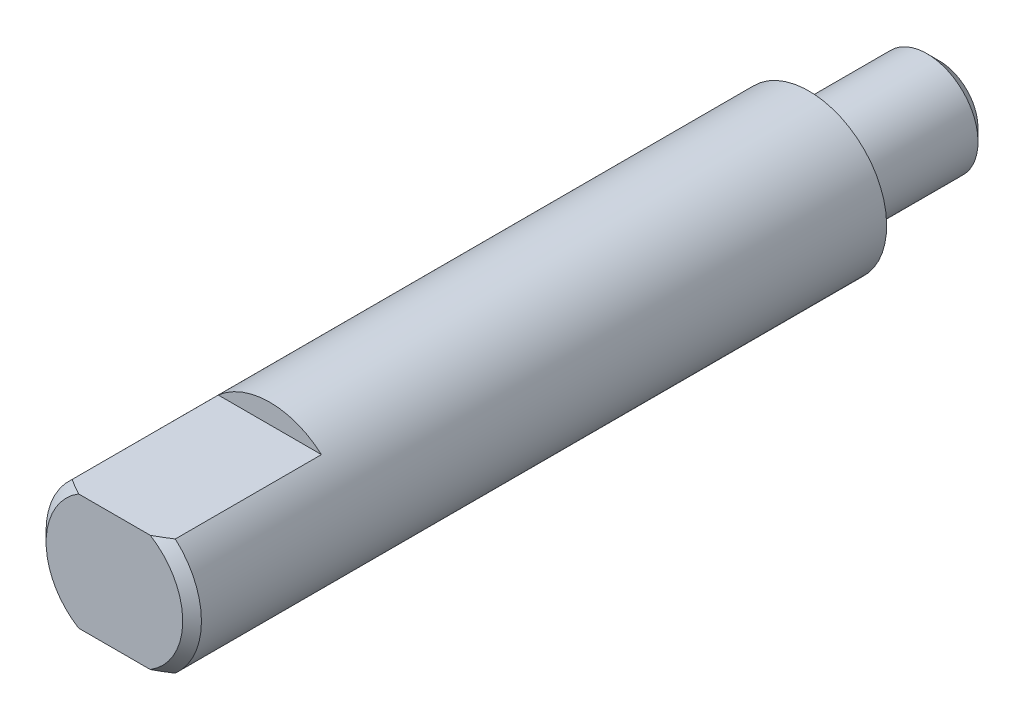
ISO-10303-21;
HEADER;
FILE_DESCRIPTION(('STEP AP214'),'2;1');
FILE_NAME('part.step','',(''),(''),'','','');
FILE_SCHEMA(('AUTOMOTIVE_DESIGN { 1 0 10303 214 1 1 1 1 }'));
ENDSEC;
DATA;
#1=APPLICATION_CONTEXT('core data for automotive mechanical design processes');
#2=APPLICATION_PROTOCOL_DEFINITION('international standard','automotive_design',2000,#1);
#3=PRODUCT_CONTEXT('',#1,'mechanical');
#4=PRODUCT('Part','Part','',(#3));
#5=PRODUCT_RELATED_PRODUCT_CATEGORY('part','',(#4));
#6=PRODUCT_DEFINITION_FORMATION('','',#4);
#7=PRODUCT_DEFINITION_CONTEXT('part definition',#1,'design');
#8=PRODUCT_DEFINITION('design','',#6,#7);
#9=PRODUCT_DEFINITION_SHAPE('','',#8);
#10=(LENGTH_UNIT() NAMED_UNIT(*) SI_UNIT(.MILLI.,.METRE.));
#11=(NAMED_UNIT(*) PLANE_ANGLE_UNIT() SI_UNIT($,.RADIAN.));
#12=(NAMED_UNIT(*) SI_UNIT($,.STERADIAN.) SOLID_ANGLE_UNIT());
#13=UNCERTAINTY_MEASURE_WITH_UNIT(LENGTH_MEASURE(1.E-05),#10,'distance_accuracy_value','');
#14=(GEOMETRIC_REPRESENTATION_CONTEXT(3) GLOBAL_UNCERTAINTY_ASSIGNED_CONTEXT((#13)) GLOBAL_UNIT_ASSIGNED_CONTEXT((#10,
#11,#12)) REPRESENTATION_CONTEXT('',''));
#15=CARTESIAN_POINT('',(0.,0.,0.));
#16=DIRECTION('',(0.,0.,1.));
#17=DIRECTION('',(1.,0.,0.));
#18=AXIS2_PLACEMENT_3D('',#15,#16,#17);
#19=CARTESIAN_POINT('',(0.,0.,3.684));
#20=DIRECTION('',(0.,0.,-1.));
#21=DIRECTION('',(0.,1.,0.));
#22=AXIS2_PLACEMENT_3D('',#19,#20,#21);
#23=CONICAL_SURFACE('',#22,3.175,0.791934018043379);
#24=CARTESIAN_POINT('',(0.,0.,3.684));
#25=DIRECTION('',(0.,0.,1.));
#26=DIRECTION('',(0.,-1.,0.));
#27=AXIS2_PLACEMENT_3D('',#24,#25,#26);
#28=CIRCLE('',#27,3.175);
#29=CARTESIAN_POINT('',(-2.10713075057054,2.375,3.684));
#30=VERTEX_POINT('',#29);
#31=CARTESIAN_POINT('',(-2.10713075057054,-2.375,3.684));
#32=VERTEX_POINT('',#31);
#33=EDGE_CURVE('E105',#30,#32,#28,.T.);
#34=ORIENTED_EDGE('',*,*,#33,.T.);
#35=CARTESIAN_POINT('',(-6.62966945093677,-2.375,-0.13301595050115));
#36=CARTESIAN_POINT('',(-6.41872085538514,-2.375,0.0629362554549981));
#37=CARTESIAN_POINT('',(-6.20729327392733,-2.375,0.258380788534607));
#38=CARTESIAN_POINT('',(-5.78286017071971,-2.375,0.647887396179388));
#39=CARTESIAN_POINT('',(-5.56985352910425,-2.375,0.841948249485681));
#40=CARTESIAN_POINT('',(-5.13574053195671,-2.375,1.23363349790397));
#41=CARTESIAN_POINT('',(-4.91457904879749,-2.375,1.43119690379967));
#42=CARTESIAN_POINT('',(-4.46963283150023,-2.375,1.82304516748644));
#43=CARTESIAN_POINT('',(-4.24585006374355,-2.375,2.01733224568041));
#44=CARTESIAN_POINT('',(-3.90719638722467,-2.375,2.30510248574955));
#45=CARTESIAN_POINT('',(-3.79385459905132,-2.375,2.40038380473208));
#46=CARTESIAN_POINT('',(-3.56590809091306,-2.375,2.58942155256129));
#47=CARTESIAN_POINT('',(-3.4513034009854,-2.375,2.68317801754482));
#48=CARTESIAN_POINT('',(-3.22025369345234,-2.375,2.86895465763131));
#49=CARTESIAN_POINT('',(-3.10380502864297,-2.375,2.96097030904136));
#50=CARTESIAN_POINT('',(-2.86892224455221,-2.375,3.14241965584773));
#51=CARTESIAN_POINT('',(-2.75048831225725,-2.375,3.23185359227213));
#52=CARTESIAN_POINT('',(-2.51255729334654,-2.375,3.40617108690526));
#53=CARTESIAN_POINT('',(-2.39309165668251,-2.375,3.49109735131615));
#54=CARTESIAN_POINT('',(-2.15090508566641,-2.375,3.65634247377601));
#55=CARTESIAN_POINT('',(-2.02818269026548,-2.375,3.73665921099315));
#56=CARTESIAN_POINT('',(-1.77912466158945,-2.375,3.89039659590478));
#57=CARTESIAN_POINT('',(-1.6528052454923,-2.375,3.96384327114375));
#58=CARTESIAN_POINT('',(-1.39512518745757,-2.375,4.10119391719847));
#59=CARTESIAN_POINT('',(-1.26377071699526,-2.375,4.16510912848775));
#60=CARTESIAN_POINT('',(-1.05701971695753,-2.375,4.25273595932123));
#61=CARTESIAN_POINT('',(-0.983728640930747,-2.375,4.28140199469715));
#62=CARTESIAN_POINT('',(-0.835356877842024,-2.375,4.33377721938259));
#63=CARTESIAN_POINT('',(-0.760275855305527,-2.375,4.35748547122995));
#64=CARTESIAN_POINT('',(-0.608898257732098,-2.375,4.39885359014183));
#65=CARTESIAN_POINT('',(-0.532610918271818,-2.375,4.41654679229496));
#66=CARTESIAN_POINT('',(-0.378780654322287,-2.375,4.44515427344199));
#67=CARTESIAN_POINT('',(-0.301238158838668,-2.375,4.45607082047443));
#68=CARTESIAN_POINT('',(-0.144559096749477,-2.375,4.47054748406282));
#69=CARTESIAN_POINT('',(-0.0654144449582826,-2.375,4.47402190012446));
#70=CARTESIAN_POINT('',(0.0928249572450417,-2.375,4.47312081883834));
#71=CARTESIAN_POINT('',(0.171919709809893,-2.375,4.4687456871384));
#72=CARTESIAN_POINT('',(0.329626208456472,-2.375,4.45241265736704));
#73=CARTESIAN_POINT('',(0.408234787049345,-2.375,4.44042470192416));
#74=CARTESIAN_POINT('',(0.56408615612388,-2.375,4.40957980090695));
#75=CARTESIAN_POINT('',(0.641328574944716,-2.375,4.39072101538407));
#76=CARTESIAN_POINT('',(0.827865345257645,-2.375,4.33746225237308));
#77=CARTESIAN_POINT('',(0.936246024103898,-2.375,4.29987709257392));
#78=CARTESIAN_POINT('',(1.14927492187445,-2.375,4.21535984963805));
#79=CARTESIAN_POINT('',(1.25392057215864,-2.375,4.16842147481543));
#80=CARTESIAN_POINT('',(1.46087103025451,-2.375,4.06709514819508));
#81=CARTESIAN_POINT('',(1.56313950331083,-2.375,4.01263383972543));
#82=CARTESIAN_POINT('',(1.71427099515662,-2.375,3.92703840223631));
#83=CARTESIAN_POINT('',(1.76426245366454,-2.375,3.89786057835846));
#84=CARTESIAN_POINT('',(1.86356372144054,-2.375,3.83837009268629));
#85=CARTESIAN_POINT('',(1.91287355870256,-2.375,3.80805747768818));
#86=CARTESIAN_POINT('',(2.07522042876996,-2.375,3.70601224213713));
#87=CARTESIAN_POINT('',(2.18692206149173,-2.375,3.63215349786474));
#88=CARTESIAN_POINT('',(2.4077231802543,-2.375,3.48062951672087));
#89=CARTESIAN_POINT('',(2.51682205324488,-2.375,3.40296339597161));
#90=CARTESIAN_POINT('',(2.73301390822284,-2.375,3.24473477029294));
#91=CARTESIAN_POINT('',(2.84010537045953,-2.375,3.16417019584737));
#92=CARTESIAN_POINT('',(3.0526172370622,-2.375,3.00086187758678));
#93=CARTESIAN_POINT('',(3.15803753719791,-2.375,2.91811799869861));
#94=CARTESIAN_POINT('',(3.47300086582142,-2.375,2.66679989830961));
#95=CARTESIAN_POINT('',(3.68051445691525,-2.375,2.49568568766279));
#96=CARTESIAN_POINT('',(4.09182405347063,-2.375,2.14926116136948));
#97=CARTESIAN_POINT('',(4.2956216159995,-2.375,1.97395267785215));
#98=CARTESIAN_POINT('',(4.67931232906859,-2.375,1.63905531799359));
#99=CARTESIAN_POINT('',(4.85946034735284,-2.375,1.47975783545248));
#100=CARTESIAN_POINT('',(5.21824582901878,-2.375,1.15942835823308));
#101=CARTESIAN_POINT('',(5.39688309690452,-2.375,0.998396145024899));
#102=CARTESIAN_POINT('',(5.75173692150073,-2.375,0.676174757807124));
#103=CARTESIAN_POINT('',(5.92796166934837,-2.375,0.514994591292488));
#104=CARTESIAN_POINT('',(6.27946145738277,-2.375,0.191659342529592));
#105=CARTESIAN_POINT('',(6.45473664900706,-2.375,0.0295044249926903));
#106=CARTESIAN_POINT('',(6.62966945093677,-2.375,-0.13301595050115));
#107=B_SPLINE_CURVE_WITH_KNOTS('',3,(#35,#36,#37,#38,#39,#40,#41,#42,#43,#44,#45,#46,#47,#48,
#49,#50,#51,#52,#53,#54,#55,#56,#57,#58,#59,#60,#61,#62,#63,#64,#65,#66,#67,#68,#69,#70,#71,#72,
#73,#74,#75,#76,#77,#78,#79,#80,#81,#82,#83,#84,#85,#86,#87,#88,#89,#90,#91,#92,#93,#94,#95,#96,
#97,#98,#99,#100,#101,#102,#103,#104,#105,#106),.UNSPECIFIED.,.F.,.F.,(4,2,2,2,2,2,2,2,2,2,2,2,
2,2,2,2,2,2,2,2,2,2,2,2,2,2,2,2,2,2,2,2,2,2,2,4),(0.,0.863760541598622,1.72820709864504,
2.6178487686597,3.50686109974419,3.95106286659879,4.39525409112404,4.84047397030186,
5.28565214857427,5.72530383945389,6.16515621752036,6.6032682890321,7.04085953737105,
7.27681206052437,7.51280915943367,7.74747620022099,7.98206465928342,8.21934033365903,
8.45660495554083,8.69481223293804,8.93308334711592,9.27660606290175,9.62036064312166,
9.96774119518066,10.1413805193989,10.3150126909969,10.7166254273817,11.1183318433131,
11.5203310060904,11.9223551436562,12.7291420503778,13.535582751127,14.2569976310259,
14.9785044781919,15.6949553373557,16.4112883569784),.UNSPECIFIED.);
#108=CARTESIAN_POINT('',(-1.46406113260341,-2.375,4.064));
#109=VERTEX_POINT('',#108);
#110=EDGE_CURVE('E128',#32,#109,#107,.T.);
#111=ORIENTED_EDGE('',*,*,#110,.T.);
#112=CARTESIAN_POINT('',(0.,0.,4.064));
#113=DIRECTION('',(0.,0.,1.));
#114=DIRECTION('',(0.,-1.,0.));
#115=AXIS2_PLACEMENT_3D('',#112,#113,#114);
#116=CIRCLE('',#115,2.79);
#117=CARTESIAN_POINT('',(-1.46406113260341,2.375,4.064));
#118=VERTEX_POINT('',#117);
#119=EDGE_CURVE('E115',#118,#109,#116,.T.);
#120=ORIENTED_EDGE('',*,*,#119,.F.);
#121=CARTESIAN_POINT('',(6.62966945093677,2.375,-0.133015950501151));
#122=CARTESIAN_POINT('',(6.41872085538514,2.375,0.0629362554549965));
#123=CARTESIAN_POINT('',(6.20729327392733,2.375,0.258380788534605));
#124=CARTESIAN_POINT('',(5.78286017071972,2.375,0.647887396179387));
#125=CARTESIAN_POINT('',(5.56985352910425,2.375,0.841948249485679));
#126=CARTESIAN_POINT('',(5.13574053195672,2.375,1.23363349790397));
#127=CARTESIAN_POINT('',(4.9145790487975,2.375,1.43119690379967));
#128=CARTESIAN_POINT('',(4.46963283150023,2.375,1.82304516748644));
#129=CARTESIAN_POINT('',(4.24585006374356,2.375,2.01733224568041));
#130=CARTESIAN_POINT('',(3.90719638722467,2.375,2.30510248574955));
#131=CARTESIAN_POINT('',(3.79385459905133,2.375,2.40038380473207));
#132=CARTESIAN_POINT('',(3.56590809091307,2.375,2.58942155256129));
#133=CARTESIAN_POINT('',(3.45130340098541,2.375,2.68317801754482));
#134=CARTESIAN_POINT('',(3.22025369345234,2.375,2.8689546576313));
#135=CARTESIAN_POINT('',(3.10380502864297,2.375,2.96097030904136));
#136=CARTESIAN_POINT('',(2.86892224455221,2.375,3.14241965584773));
#137=CARTESIAN_POINT('',(2.75048831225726,2.375,3.23185359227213));
#138=CARTESIAN_POINT('',(2.51255729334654,2.375,3.40617108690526));
#139=CARTESIAN_POINT('',(2.39309165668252,2.375,3.49109735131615));
#140=CARTESIAN_POINT('',(2.15090508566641,2.375,3.65634247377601));
#141=CARTESIAN_POINT('',(2.02818269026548,2.375,3.73665921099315));
#142=CARTESIAN_POINT('',(1.77912466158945,2.375,3.89039659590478));
#143=CARTESIAN_POINT('',(1.6528052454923,2.375,3.96384327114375));
#144=CARTESIAN_POINT('',(1.39512518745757,2.375,4.10119391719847));
#145=CARTESIAN_POINT('',(1.26377071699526,2.375,4.16510912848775));
#146=CARTESIAN_POINT('',(1.05701971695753,2.375,4.25273595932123));
#147=CARTESIAN_POINT('',(0.98372864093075,2.375,4.28140199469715));
#148=CARTESIAN_POINT('',(0.835356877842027,2.375,4.33377721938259));
#149=CARTESIAN_POINT('',(0.760275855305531,2.375,4.35748547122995));
#150=CARTESIAN_POINT('',(0.608898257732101,2.375,4.39885359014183));
#151=CARTESIAN_POINT('',(0.53261091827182,2.375,4.41654679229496));
#152=CARTESIAN_POINT('',(0.37878065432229,2.375,4.445154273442));
#153=CARTESIAN_POINT('',(0.301238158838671,2.375,4.45607082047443));
#154=CARTESIAN_POINT('',(0.14455909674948,2.375,4.47054748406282));
#155=CARTESIAN_POINT('',(0.0654144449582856,2.375,4.47402190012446));
#156=CARTESIAN_POINT('',(-0.0928249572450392,2.375,4.47312081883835));
#157=CARTESIAN_POINT('',(-0.171919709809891,2.375,4.4687456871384));
#158=CARTESIAN_POINT('',(-0.329626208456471,2.375,4.45241265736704));
#159=CARTESIAN_POINT('',(-0.408234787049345,2.375,4.44042470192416));
#160=CARTESIAN_POINT('',(-0.56408615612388,2.375,4.40957980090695));
#161=CARTESIAN_POINT('',(-0.641328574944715,2.375,4.39072101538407));
#162=CARTESIAN_POINT('',(-0.827865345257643,2.375,4.33746225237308));
#163=CARTESIAN_POINT('',(-0.936246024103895,2.375,4.29987709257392));
#164=CARTESIAN_POINT('',(-1.14927492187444,2.375,4.21535984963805));
#165=CARTESIAN_POINT('',(-1.25392057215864,2.375,4.16842147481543));
#166=CARTESIAN_POINT('',(-1.46087103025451,2.375,4.06709514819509));
#167=CARTESIAN_POINT('',(-1.56313950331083,2.375,4.01263383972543));
#168=CARTESIAN_POINT('',(-1.71427099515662,2.375,3.92703840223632));
#169=CARTESIAN_POINT('',(-1.76426245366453,2.375,3.89786057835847));
#170=CARTESIAN_POINT('',(-1.86356372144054,2.375,3.8383700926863));
#171=CARTESIAN_POINT('',(-1.91287355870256,2.375,3.80805747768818));
#172=CARTESIAN_POINT('',(-2.07522042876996,2.375,3.70601224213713));
#173=CARTESIAN_POINT('',(-2.18692206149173,2.375,3.63215349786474));
#174=CARTESIAN_POINT('',(-2.40772318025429,2.375,3.48062951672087));
#175=CARTESIAN_POINT('',(-2.51682205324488,2.375,3.40296339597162));
#176=CARTESIAN_POINT('',(-2.73301390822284,2.375,3.24473477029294));
#177=CARTESIAN_POINT('',(-2.84010537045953,2.375,3.16417019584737));
#178=CARTESIAN_POINT('',(-3.0526172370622,2.375,3.00086187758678));
#179=CARTESIAN_POINT('',(-3.15803753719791,2.375,2.91811799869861));
#180=CARTESIAN_POINT('',(-3.47300086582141,2.375,2.66679989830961));
#181=CARTESIAN_POINT('',(-3.68051445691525,2.375,2.4956856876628));
#182=CARTESIAN_POINT('',(-4.09182405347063,2.375,2.14926116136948));
#183=CARTESIAN_POINT('',(-4.2956216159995,2.375,1.97395267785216));
#184=CARTESIAN_POINT('',(-4.67931232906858,2.375,1.63905531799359));
#185=CARTESIAN_POINT('',(-4.85946034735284,2.375,1.47975783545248));
#186=CARTESIAN_POINT('',(-5.21824582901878,2.375,1.15942835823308));
#187=CARTESIAN_POINT('',(-5.39688309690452,2.375,0.998396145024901));
#188=CARTESIAN_POINT('',(-5.75173692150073,2.375,0.676174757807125));
#189=CARTESIAN_POINT('',(-5.92796166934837,2.375,0.51499459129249));
#190=CARTESIAN_POINT('',(-6.27946145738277,2.375,0.191659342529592));
#191=CARTESIAN_POINT('',(-6.45473664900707,2.375,0.02950442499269));
#192=CARTESIAN_POINT('',(-6.62966945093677,2.375,-0.13301595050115));
#193=B_SPLINE_CURVE_WITH_KNOTS('',3,(#121,#122,#123,#124,#125,#126,#127,#128,#129,#130,#131,
#132,#133,#134,#135,#136,#137,#138,#139,#140,#141,#142,#143,#144,#145,#146,#147,#148,#149,#150,
#151,#152,#153,#154,#155,#156,#157,#158,#159,#160,#161,#162,#163,#164,#165,#166,#167,#168,#169,
#170,#171,#172,#173,#174,#175,#176,#177,#178,#179,#180,#181,#182,#183,#184,#185,#186,#187,#188,
#189,#190,#191,#192),.UNSPECIFIED.,.F.,.F.,(4,2,2,2,2,2,2,2,2,2,2,2,2,2,2,2,2,2,2,2,2,2,2,2,2,2,
2,2,2,2,2,2,2,2,2,4),(0.,0.863760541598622,1.72820709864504,2.6178487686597,3.5068610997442,
3.95106286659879,4.39525409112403,4.84047397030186,5.28565214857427,5.72530383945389,
6.16515621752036,6.6032682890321,7.04085953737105,7.27681206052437,7.51280915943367,
7.74747620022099,7.98206465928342,8.21934033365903,8.45660495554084,8.69481223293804,
8.93308334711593,9.27660606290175,9.62036064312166,9.96774119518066,10.1413805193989,
10.3150126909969,10.7166254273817,11.1183318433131,11.5203310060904,11.9223551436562,
12.7291420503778,13.5355827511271,14.2569976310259,14.9785044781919,15.6949553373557,
16.4112883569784),.UNSPECIFIED.);
#194=EDGE_CURVE('E129',#118,#30,#193,.T.);
#195=ORIENTED_EDGE('',*,*,#194,.T.);
#196=EDGE_LOOP('',(#34,#111,#120,#195));
#197=FACE_BOUND('',#196,.T.);
#198=ADVANCED_FACE('F33',(#197),#23,.T.);
#199=CARTESIAN_POINT('',(0.,0.,4.064));
#200=DIRECTION('',(0.,0.,-1.));
#201=DIRECTION('',(0.,1.,0.));
#202=AXIS2_PLACEMENT_3D('',#199,#200,#201);
#203=PLANE('',#202);
#204=ORIENTED_EDGE('',*,*,#119,.T.);
#205=DIRECTION('',(1.,0.,0.));
#206=VECTOR('',#205,1.);
#207=CARTESIAN_POINT('',(-5.,-2.375,4.064));
#208=LINE('',#207,#206);
#209=CARTESIAN_POINT('',(1.46406113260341,-2.375,4.064));
#210=VERTEX_POINT('',#209);
#211=EDGE_CURVE('E95',#109,#210,#208,.T.);
#212=ORIENTED_EDGE('',*,*,#211,.T.);
#213=CARTESIAN_POINT('',(1.46406113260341,2.375,4.064));
#214=VERTEX_POINT('',#213);
#215=EDGE_CURVE('E109',#210,#214,#116,.T.);
#216=ORIENTED_EDGE('',*,*,#215,.T.);
#217=DIRECTION('',(1.,0.,0.));
#218=VECTOR('',#217,1.);
#219=CARTESIAN_POINT('',(-5.,2.375,4.064));
#220=LINE('',#219,#218);
#221=EDGE_CURVE('E135',#118,#214,#220,.T.);
#222=ORIENTED_EDGE('',*,*,#221,.F.);
#223=EDGE_LOOP('',(#204,#212,#216,#222));
#224=FACE_BOUND('',#223,.T.);
#225=ADVANCED_FACE('F35',(#224),#203,.F.);
#226=ORIENTED_EDGE('',*,*,#215,.F.);
#227=CARTESIAN_POINT('',(2.10713075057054,-2.375,3.684));
#228=VERTEX_POINT('',#227);
#229=EDGE_CURVE('E94',#210,#228,#107,.T.);
#230=ORIENTED_EDGE('',*,*,#229,.T.);
#231=CARTESIAN_POINT('',(2.10713075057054,2.375,3.684));
#232=VERTEX_POINT('',#231);
#233=EDGE_CURVE('E101',#228,#232,#28,.T.);
#234=ORIENTED_EDGE('',*,*,#233,.T.);
#235=EDGE_CURVE('E132',#232,#214,#193,.T.);
#236=ORIENTED_EDGE('',*,*,#235,.T.);
#237=EDGE_LOOP('',(#226,#230,#234,#236));
#238=FACE_BOUND('',#237,.T.);
#239=ADVANCED_FACE('F144',(#238),#23,.T.);
#240=CARTESIAN_POINT('',(0.,0.,4.064));
#241=DIRECTION('',(0.,0.,1.));
#242=DIRECTION('',(0.,-1.,0.));
#243=AXIS2_PLACEMENT_3D('',#240,#241,#242);
#244=CYLINDRICAL_SURFACE('',#243,3.175);
#245=ORIENTED_EDGE('',*,*,#233,.F.);
#246=DIRECTION('',(0.,0.,1.));
#247=VECTOR('',#246,1.);
#248=CARTESIAN_POINT('',(2.10713075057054,-2.375,4.064));
#249=LINE('',#248,#247);
#250=CARTESIAN_POINT('',(2.10713075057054,-2.375,-2.286));
#251=VERTEX_POINT('',#250);
#252=EDGE_CURVE('E11',#228,#251,#249,.F.);
#253=ORIENTED_EDGE('',*,*,#252,.T.);
#254=CARTESIAN_POINT('',(0.,0.,-2.286));
#255=DIRECTION('',(0.,0.,-1.));
#256=DIRECTION('',(-1.,0.,0.));
#257=AXIS2_PLACEMENT_3D('',#254,#255,#256);
#258=CIRCLE('',#257,3.175);
#259=CARTESIAN_POINT('',(-2.10713075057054,-2.375,-2.286));
#260=VERTEX_POINT('',#259);
#261=EDGE_CURVE('E85',#251,#260,#258,.T.);
#262=ORIENTED_EDGE('',*,*,#261,.T.);
#263=DIRECTION('',(0.,0.,1.));
#264=VECTOR('',#263,1.);
#265=CARTESIAN_POINT('',(-2.10713075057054,-2.375,4.064));
#266=LINE('',#265,#264);
#267=EDGE_CURVE('E41',#260,#32,#266,.T.);
#268=ORIENTED_EDGE('',*,*,#267,.T.);
#269=ORIENTED_EDGE('',*,*,#33,.F.);
#270=DIRECTION('',(0.,0.,1.));
#271=VECTOR('',#270,1.);
#272=CARTESIAN_POINT('',(-2.10713075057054,2.375,4.064));
#273=LINE('',#272,#271);
#274=CARTESIAN_POINT('',(-2.10713075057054,2.37500000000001,-2.286));
#275=VERTEX_POINT('',#274);
#276=EDGE_CURVE('E118',#30,#275,#273,.F.);
#277=ORIENTED_EDGE('',*,*,#276,.T.);
#278=CARTESIAN_POINT('',(0.,0.,-2.286));
#279=DIRECTION('',(0.,0.,-1.));
#280=DIRECTION('',(-1.,0.,0.));
#281=AXIS2_PLACEMENT_3D('',#278,#279,#280);
#282=CIRCLE('',#281,3.175);
#283=CARTESIAN_POINT('',(2.10713075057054,2.375,-2.286));
#284=VERTEX_POINT('',#283);
#285=EDGE_CURVE('E121',#275,#284,#282,.T.);
#286=ORIENTED_EDGE('',*,*,#285,.T.);
#287=DIRECTION('',(0.,0.,1.));
#288=VECTOR('',#287,1.);
#289=CARTESIAN_POINT('',(2.10713075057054,2.375,4.064));
#290=LINE('',#289,#288);
#291=EDGE_CURVE('E89',#284,#232,#290,.T.);
#292=ORIENTED_EDGE('',*,*,#291,.T.);
#293=EDGE_LOOP('',(#245,#253,#262,#268,#269,#277,#286,#292));
#294=FACE_BOUND('',#293,.T.);
#295=CARTESIAN_POINT('',(0.,0.,-24.3078));
#296=DIRECTION('',(0.,0.,1.));
#297=DIRECTION('',(0.,-1.,0.));
#298=AXIS2_PLACEMENT_3D('',#295,#296,#297);
#299=CIRCLE('',#298,3.17499999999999);
#300=CARTESIAN_POINT('',(0.,-3.17499999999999,-24.3078));
#301=VERTEX_POINT('',#300);
#302=EDGE_CURVE('E106',#301,#301,#299,.T.);
#303=ORIENTED_EDGE('',*,*,#302,.T.);
#304=EDGE_LOOP('',(#303));
#305=FACE_BOUND('',#304,.T.);
#306=ADVANCED_FACE('F98',(#294,#305),#244,.T.);
#307=CARTESIAN_POINT('',(0.,2.08280000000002,-24.3078));
#308=DIRECTION('',(0.,0.,1.));
#309=DIRECTION('',(0.,-1.,0.));
#310=AXIS2_PLACEMENT_3D('',#307,#308,#309);
#311=PLANE('',#310);
#312=ORIENTED_EDGE('',*,*,#302,.F.);
#313=EDGE_LOOP('',(#312));
#314=FACE_BOUND('',#313,.T.);
#315=CARTESIAN_POINT('',(0.,0.,-24.3078));
#316=DIRECTION('',(0.,0.,1.));
#317=DIRECTION('',(0.,-1.,0.));
#318=AXIS2_PLACEMENT_3D('',#315,#316,#317);
#319=CIRCLE('',#318,2.08280000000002);
#320=CARTESIAN_POINT('',(0.,-2.08280000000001,-24.3078));
#321=VERTEX_POINT('',#320);
#322=EDGE_CURVE('E111',#321,#321,#319,.T.);
#323=ORIENTED_EDGE('',*,*,#322,.T.);
#324=EDGE_LOOP('',(#323));
#325=FACE_BOUND('',#324,.T.);
#326=ADVANCED_FACE('F165',(#314,#325),#311,.F.);
#327=CARTESIAN_POINT('',(0.,0.,4.064));
#328=DIRECTION('',(0.,0.,1.));
#329=DIRECTION('',(0.,-1.,0.));
#330=AXIS2_PLACEMENT_3D('',#327,#328,#329);
#331=CYLINDRICAL_SURFACE('',#330,2.08280000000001);
#332=ORIENTED_EDGE('',*,*,#322,.F.);
#333=EDGE_LOOP('',(#332));
#334=FACE_BOUND('',#333,.T.);
#335=CARTESIAN_POINT('',(0.,0.,-29.1318));
#336=DIRECTION('',(0.,0.,1.));
#337=DIRECTION('',(0.,-1.,0.));
#338=AXIS2_PLACEMENT_3D('',#335,#336,#337);
#339=CIRCLE('',#338,2.08280000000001);
#340=CARTESIAN_POINT('',(0.,-2.08280000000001,-29.1318));
#341=VERTEX_POINT('',#340);
#342=EDGE_CURVE('E263',#341,#341,#339,.T.);
#343=ORIENTED_EDGE('',*,*,#342,.T.);
#344=EDGE_LOOP('',(#343));
#345=FACE_BOUND('',#344,.T.);
#346=ADVANCED_FACE('F161',(#334,#345),#331,.T.);
#347=CARTESIAN_POINT('',(0.,0.,-29.6418));
#348=DIRECTION('',(0.,0.,1.));
#349=DIRECTION('',(0.,-1.,0.));
#350=AXIS2_PLACEMENT_3D('',#347,#348,#349);
#351=CONICAL_SURFACE('',#350,1.57,0.788135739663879);
#352=ORIENTED_EDGE('',*,*,#342,.F.);
#353=EDGE_LOOP('',(#352));
#354=FACE_BOUND('',#353,.T.);
#355=CARTESIAN_POINT('',(0.,0.,-29.6418));
#356=DIRECTION('',(0.,0.,1.));
#357=DIRECTION('',(0.,-1.,0.));
#358=AXIS2_PLACEMENT_3D('',#355,#356,#357);
#359=CIRCLE('',#358,1.57);
#360=CARTESIAN_POINT('',(0.,-1.56999999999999,-29.6418));
#361=VERTEX_POINT('',#360);
#362=EDGE_CURVE('E134',#361,#361,#359,.T.);
#363=ORIENTED_EDGE('',*,*,#362,.T.);
#364=EDGE_LOOP('',(#363));
#365=FACE_BOUND('',#364,.T.);
#366=ADVANCED_FACE('F157',(#354,#365),#351,.T.);
#367=CARTESIAN_POINT('',(0.,0.,-29.6418));
#368=DIRECTION('',(0.,0.,1.));
#369=DIRECTION('',(0.,-1.,0.));
#370=AXIS2_PLACEMENT_3D('',#367,#368,#369);
#371=PLANE('',#370);
#372=ORIENTED_EDGE('',*,*,#362,.F.);
#373=EDGE_LOOP('',(#372));
#374=FACE_BOUND('',#373,.T.);
#375=ADVANCED_FACE('F154',(#374),#371,.F.);
#376=CARTESIAN_POINT('',(-5.,2.375,-2.286));
#377=DIRECTION('',(0.,0.,-1.));
#378=DIRECTION('',(-1.,0.,0.));
#379=AXIS2_PLACEMENT_3D('',#376,#377,#378);
#380=PLANE('',#379);
#381=DIRECTION('',(1.,0.,0.));
#382=VECTOR('',#381,1.);
#383=CARTESIAN_POINT('',(-5.,2.375,-2.286));
#384=LINE('',#383,#382);
#385=EDGE_CURVE('E55',#275,#284,#384,.T.);
#386=ORIENTED_EDGE('',*,*,#385,.T.);
#387=ORIENTED_EDGE('',*,*,#285,.F.);
#388=EDGE_LOOP('',(#386,#387));
#389=FACE_BOUND('',#388,.T.);
#390=ADVANCED_FACE('F152',(#389),#380,.F.);
#391=CARTESIAN_POINT('',(-5.,2.375,4.064));
#392=DIRECTION('',(0.,-1.,0.));
#393=DIRECTION('',(0.,0.,-1.));
#394=AXIS2_PLACEMENT_3D('',#391,#392,#393);
#395=PLANE('',#394);
#396=ORIENTED_EDGE('',*,*,#291,.F.);
#397=ORIENTED_EDGE('',*,*,#385,.F.);
#398=ORIENTED_EDGE('',*,*,#276,.F.);
#399=ORIENTED_EDGE('',*,*,#194,.F.);
#400=ORIENTED_EDGE('',*,*,#221,.T.);
#401=ORIENTED_EDGE('',*,*,#235,.F.);
#402=EDGE_LOOP('',(#396,#397,#398,#399,#400,#401));
#403=FACE_BOUND('',#402,.T.);
#404=ADVANCED_FACE('F147',(#403),#395,.F.);
#405=CARTESIAN_POINT('',(-5.,-2.375,4.064));
#406=DIRECTION('',(0.,1.,0.));
#407=DIRECTION('',(0.,0.,1.));
#408=AXIS2_PLACEMENT_3D('',#405,#406,#407);
#409=PLANE('',#408);
#410=ORIENTED_EDGE('',*,*,#267,.F.);
#411=DIRECTION('',(1.,0.,0.));
#412=VECTOR('',#411,1.);
#413=CARTESIAN_POINT('',(-5.,-2.375,-2.286));
#414=LINE('',#413,#412);
#415=EDGE_CURVE('E47',#260,#251,#414,.T.);
#416=ORIENTED_EDGE('',*,*,#415,.T.);
#417=ORIENTED_EDGE('',*,*,#252,.F.);
#418=ORIENTED_EDGE('',*,*,#229,.F.);
#419=ORIENTED_EDGE('',*,*,#211,.F.);
#420=ORIENTED_EDGE('',*,*,#110,.F.);
#421=EDGE_LOOP('',(#410,#416,#417,#418,#419,#420));
#422=FACE_BOUND('',#421,.T.);
#423=ADVANCED_FACE('F92',(#422),#409,.F.);
#424=CARTESIAN_POINT('',(-5.,-2.375,-2.286));
#425=DIRECTION('',(0.,0.,-1.));
#426=DIRECTION('',(-1.,0.,0.));
#427=AXIS2_PLACEMENT_3D('',#424,#425,#426);
#428=PLANE('',#427);
#429=ORIENTED_EDGE('',*,*,#415,.F.);
#430=ORIENTED_EDGE('',*,*,#261,.F.);
#431=EDGE_LOOP('',(#429,#430));
#432=FACE_BOUND('',#431,.T.);
#433=ADVANCED_FACE('F86',(#432),#428,.F.);
#434=CLOSED_SHELL('',(#198,#225,#239,#306,#326,#346,#366,#375,#390,#404,#423,#433));
#435=MANIFOLD_SOLID_BREP('B2',#434);
#436=ADVANCED_BREP_SHAPE_REPRESENTATION('',(#18,#435),#14);
#437=SHAPE_DEFINITION_REPRESENTATION(#9,#436);
ENDSEC;
END-ISO-10303-21;
